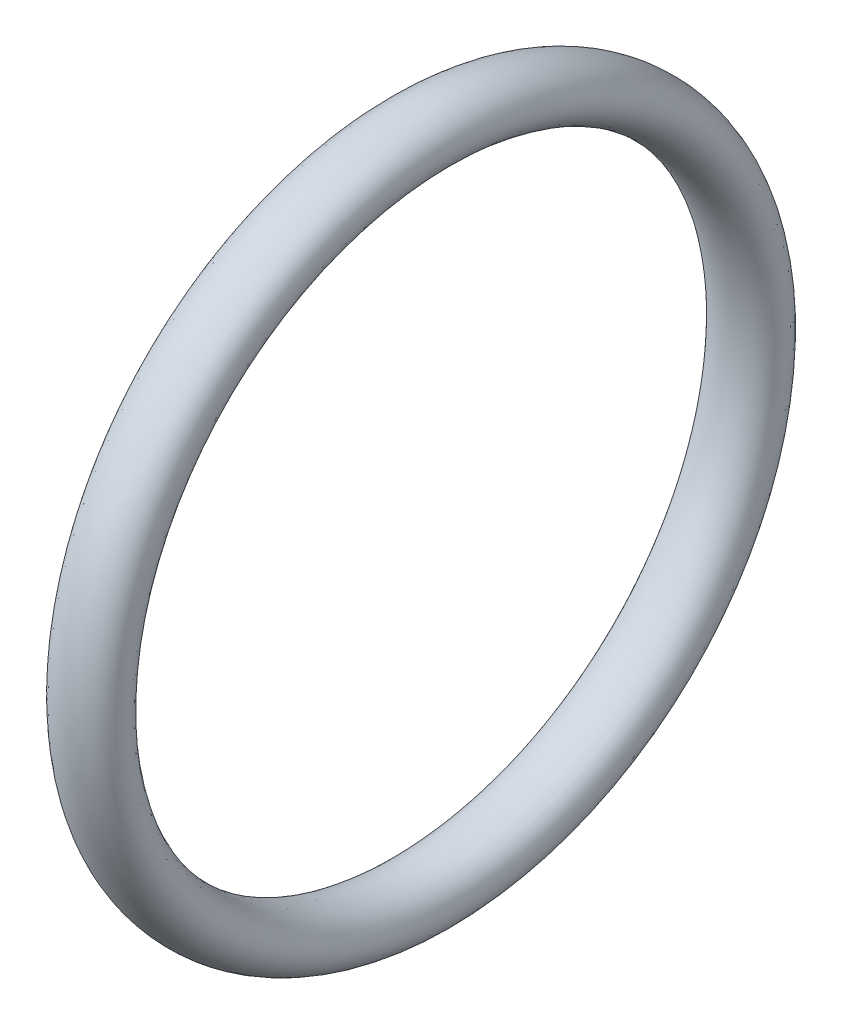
from build123d import *

# Parameters (mm, degrees)
ESQUISSE2_RX = 2
ESQUISSE2_RY = 1.5


with BuildPart() as part:
    # Esquisse2 → R_volution1 (revolve)
    with BuildSketch(Plane.XY):
        with Locations(Location((0, 18.5), (0, 0, 0))):
            Ellipse(ESQUISSE2_RX, ESQUISSE2_RY)
    revolve(axis=Axis((0, 0, 0), (1, 0, 0)))


solid = part.part
